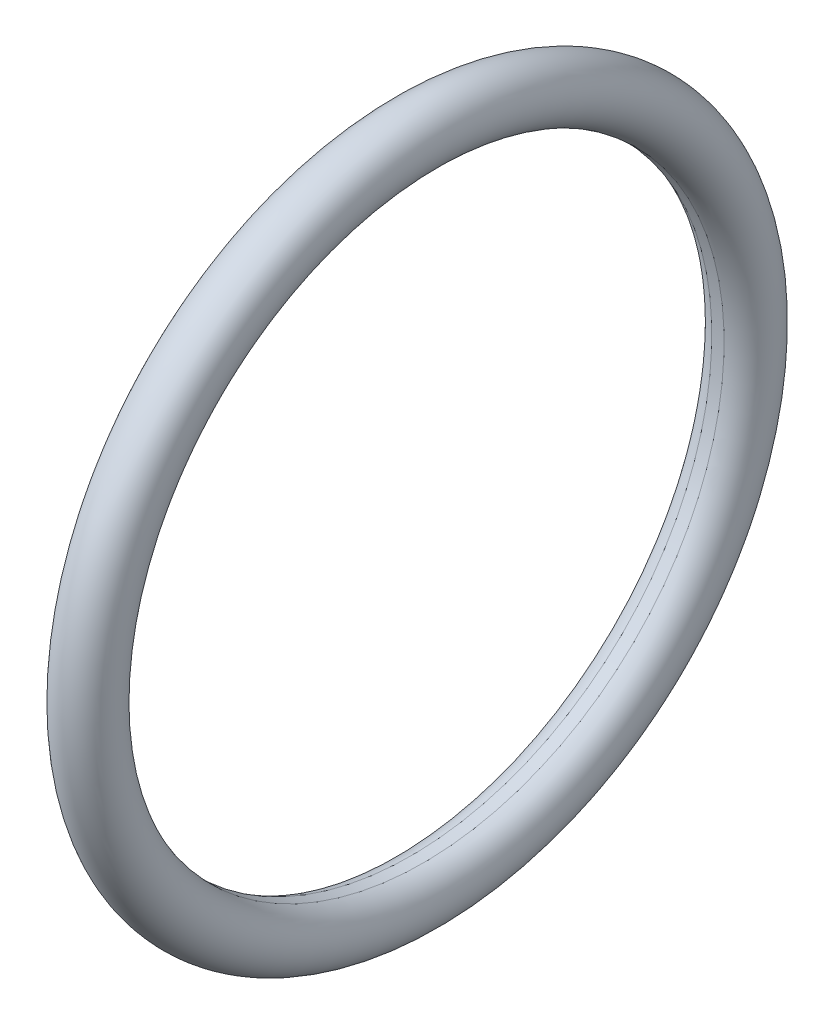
ISO-10303-21;
HEADER;
FILE_DESCRIPTION(('STEP AP214'),'2;1');
FILE_NAME('part.step','',(''),(''),'','','');
FILE_SCHEMA(('AUTOMOTIVE_DESIGN { 1 0 10303 214 1 1 1 1 }'));
ENDSEC;
DATA;
#1=APPLICATION_CONTEXT('core data for automotive mechanical design processes');
#2=APPLICATION_PROTOCOL_DEFINITION('international standard','automotive_design',2000,#1);
#3=PRODUCT_CONTEXT('',#1,'mechanical');
#4=PRODUCT('Part','Part','',(#3));
#5=PRODUCT_RELATED_PRODUCT_CATEGORY('part','',(#4));
#6=PRODUCT_DEFINITION_FORMATION('','',#4);
#7=PRODUCT_DEFINITION_CONTEXT('part definition',#1,'design');
#8=PRODUCT_DEFINITION('design','',#6,#7);
#9=PRODUCT_DEFINITION_SHAPE('','',#8);
#10=(LENGTH_UNIT() NAMED_UNIT(*) SI_UNIT(.MILLI.,.METRE.));
#11=(NAMED_UNIT(*) PLANE_ANGLE_UNIT() SI_UNIT($,.RADIAN.));
#12=(NAMED_UNIT(*) SI_UNIT($,.STERADIAN.) SOLID_ANGLE_UNIT());
#13=UNCERTAINTY_MEASURE_WITH_UNIT(LENGTH_MEASURE(1.E-05),#10,'distance_accuracy_value','');
#14=(GEOMETRIC_REPRESENTATION_CONTEXT(3) GLOBAL_UNCERTAINTY_ASSIGNED_CONTEXT((#13)) GLOBAL_UNIT_ASSIGNED_CONTEXT((#10,
#11,#12)) REPRESENTATION_CONTEXT('',''));
#15=CARTESIAN_POINT('',(0.,0.,0.));
#16=DIRECTION('',(0.,0.,1.));
#17=DIRECTION('',(1.,0.,0.));
#18=AXIS2_PLACEMENT_3D('',#15,#16,#17);
#19=CARTESIAN_POINT('',(-10.,70.,0.));
#20=DIRECTION('',(-1.,0.,0.));
#21=DIRECTION('',(0.,0.,1.));
#22=AXIS2_PLACEMENT_3D('',#19,#20,#21);
#23=TOROIDAL_SURFACE('',#22,17.,1.5);
#24=CARTESIAN_POINT('',(-10.3170339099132,70.,0.));
#25=DIRECTION('',(-1.,0.,0.));
#26=DIRECTION('',(0.,0.,1.));
#27=AXIS2_PLACEMENT_3D('',#24,#25,#26);
#28=CIRCLE('',#27,15.5338862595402);
#29=CARTESIAN_POINT('',(-10.3170339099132,70.,15.5338862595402));
#30=VERTEX_POINT('',#29);
#31=EDGE_CURVE('E10',#30,#30,#28,.T.);
#32=ORIENTED_EDGE('',*,*,#31,.F.);
#33=EDGE_LOOP('',(#32));
#34=FACE_BOUND('',#33,.T.);
#35=CARTESIAN_POINT('',(-11.4908642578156,70.,0.));
#36=DIRECTION('',(-1.,0.,0.));
#37=DIRECTION('',(0.,0.,1.));
#38=AXIS2_PLACEMENT_3D('',#35,#36,#37);
#39=CIRCLE('',#38,16.8347009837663);
#40=CARTESIAN_POINT('',(-11.4908642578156,70.,16.8347009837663));
#41=VERTEX_POINT('',#40);
#42=EDGE_CURVE('E37',#41,#41,#39,.T.);
#43=ORIENTED_EDGE('',*,*,#42,.T.);
#44=EDGE_LOOP('',(#43));
#45=FACE_BOUND('',#44,.T.);
#46=ADVANCED_FACE('F22',(#34,#45),#23,.T.);
#47=CARTESIAN_POINT('',(-20.,70.,0.));
#48=DIRECTION('',(-1.,0.,0.));
#49=DIRECTION('',(0.,0.,1.));
#50=AXIS2_PLACEMENT_3D('',#47,#48,#49);
#51=CYLINDRICAL_SURFACE('',#50,15.5338862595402);
#52=ORIENTED_EDGE('',*,*,#31,.T.);
#53=EDGE_LOOP('',(#52));
#54=FACE_BOUND('',#53,.T.);
#55=CARTESIAN_POINT('',(-9.68296609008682,70.,0.));
#56=DIRECTION('',(-1.,0.,0.));
#57=DIRECTION('',(0.,0.,1.));
#58=AXIS2_PLACEMENT_3D('',#55,#56,#57);
#59=CIRCLE('',#58,15.5338862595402);
#60=CARTESIAN_POINT('',(-9.68296609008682,70.,15.5338862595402));
#61=VERTEX_POINT('',#60);
#62=EDGE_CURVE('E29',#61,#61,#59,.T.);
#63=ORIENTED_EDGE('',*,*,#62,.F.);
#64=EDGE_LOOP('',(#63));
#65=FACE_BOUND('',#64,.T.);
#66=ADVANCED_FACE('F24',(#54,#65),#51,.F.);
#67=CARTESIAN_POINT('',(-11.4908642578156,70.,0.));
#68=DIRECTION('',(-1.,0.,0.));
#69=DIRECTION('',(0.,0.,1.));
#70=AXIS2_PLACEMENT_3D('',#67,#68,#69);
#71=CIRCLE('',#70,17.1652990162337);
#72=CARTESIAN_POINT('',(-11.4908642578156,70.,17.1652990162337));
#73=VERTEX_POINT('',#72);
#74=EDGE_CURVE('E33',#73,#73,#71,.T.);
#75=ORIENTED_EDGE('',*,*,#74,.F.);
#76=EDGE_LOOP('',(#75));
#77=FACE_BOUND('',#76,.T.);
#78=ORIENTED_EDGE('',*,*,#62,.T.);
#79=EDGE_LOOP('',(#78));
#80=FACE_BOUND('',#79,.T.);
#81=ADVANCED_FACE('F47',(#77,#80),#23,.T.);
#82=CARTESIAN_POINT('',(-11.4908642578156,87.1652990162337,0.));
#83=DIRECTION('',(1.,0.,0.));
#84=DIRECTION('',(0.,0.,-1.));
#85=AXIS2_PLACEMENT_3D('',#82,#83,#84);
#86=PLANE('',#85);
#87=ORIENTED_EDGE('',*,*,#42,.F.);
#88=EDGE_LOOP('',(#87));
#89=FACE_BOUND('',#88,.T.);
#90=ORIENTED_EDGE('',*,*,#74,.T.);
#91=EDGE_LOOP('',(#90));
#92=FACE_BOUND('',#91,.T.);
#93=ADVANCED_FACE('F44',(#89,#92),#86,.F.);
#94=CLOSED_SHELL('',(#46,#66,#81,#93));
#95=MANIFOLD_SOLID_BREP('B2',#94);
#96=ADVANCED_BREP_SHAPE_REPRESENTATION('',(#18,#95),#14);
#97=SHAPE_DEFINITION_REPRESENTATION(#9,#96);
ENDSEC;
END-ISO-10303-21;
